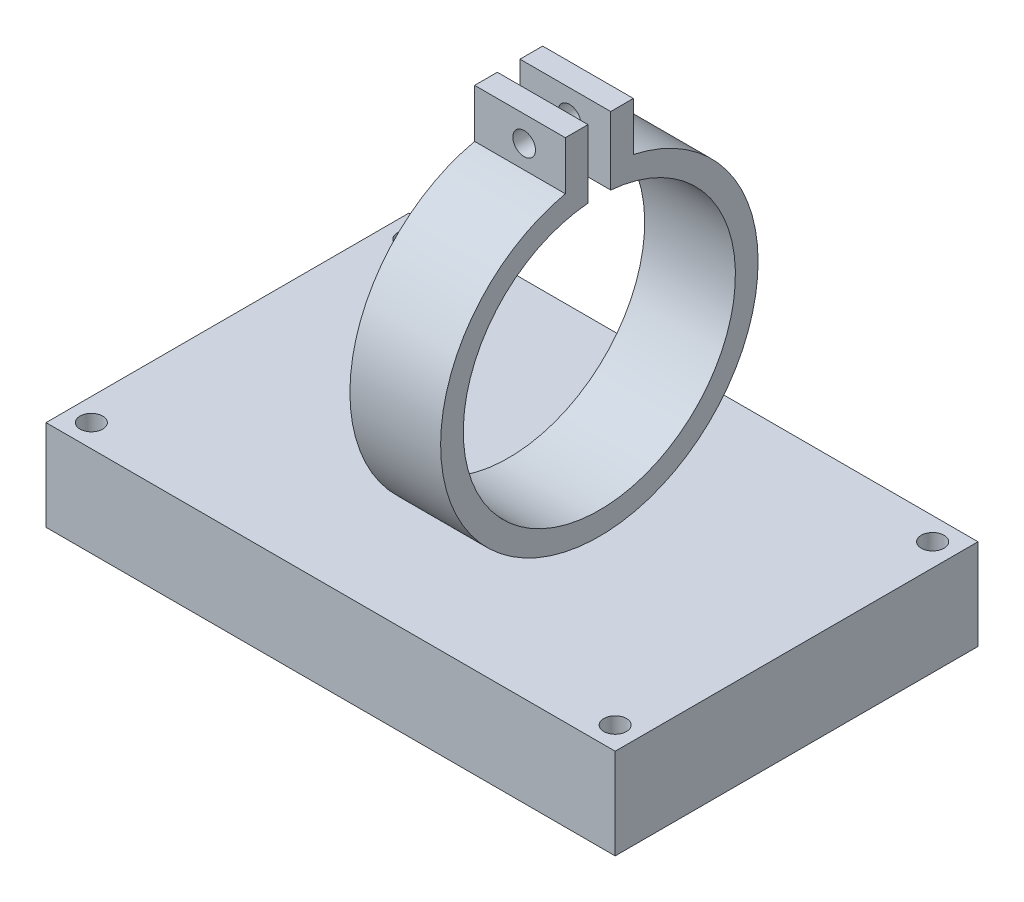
ISO-10303-21;
HEADER;
FILE_DESCRIPTION(('STEP AP214'),'2;1');
FILE_NAME('part.step','',(''),(''),'','','');
FILE_SCHEMA(('AUTOMOTIVE_DESIGN { 1 0 10303 214 1 1 1 1 }'));
ENDSEC;
DATA;
#1=APPLICATION_CONTEXT('core data for automotive mechanical design processes');
#2=APPLICATION_PROTOCOL_DEFINITION('international standard','automotive_design',2000,#1);
#3=PRODUCT_CONTEXT('',#1,'mechanical');
#4=PRODUCT('Part','Part','',(#3));
#5=PRODUCT_RELATED_PRODUCT_CATEGORY('part','',(#4));
#6=PRODUCT_DEFINITION_FORMATION('','',#4);
#7=PRODUCT_DEFINITION_CONTEXT('part definition',#1,'design');
#8=PRODUCT_DEFINITION('design','',#6,#7);
#9=PRODUCT_DEFINITION_SHAPE('','',#8);
#10=(LENGTH_UNIT() NAMED_UNIT(*) SI_UNIT(.MILLI.,.METRE.));
#11=(NAMED_UNIT(*) PLANE_ANGLE_UNIT() SI_UNIT($,.RADIAN.));
#12=(NAMED_UNIT(*) SI_UNIT($,.STERADIAN.) SOLID_ANGLE_UNIT());
#13=UNCERTAINTY_MEASURE_WITH_UNIT(LENGTH_MEASURE(1.E-05),#10,'distance_accuracy_value','');
#14=(GEOMETRIC_REPRESENTATION_CONTEXT(3) GLOBAL_UNCERTAINTY_ASSIGNED_CONTEXT((#13)) GLOBAL_UNIT_ASSIGNED_CONTEXT((#10,
#11,#12)) REPRESENTATION_CONTEXT('',''));
#15=CARTESIAN_POINT('',(0.,0.,0.));
#16=DIRECTION('',(0.,0.,1.));
#17=DIRECTION('',(1.,0.,0.));
#18=AXIS2_PLACEMENT_3D('',#15,#16,#17);
#19=CARTESIAN_POINT('',(20.,55.,0.737992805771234));
#20=DIRECTION('',(-1.,0.,0.));
#21=DIRECTION('',(0.,0.,1.));
#22=AXIS2_PLACEMENT_3D('',#19,#20,#21);
#23=CYLINDRICAL_SURFACE('',#22,35.);
#24=CARTESIAN_POINT('',(20.,55.,0.737992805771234));
#25=DIRECTION('',(1.,0.,0.));
#26=DIRECTION('',(0.,0.,-1.));
#27=AXIS2_PLACEMENT_3D('',#24,#25,#26);
#28=CIRCLE('',#27,35.);
#29=CARTESIAN_POINT('',(20.,89.1869858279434,8.23799280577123));
#30=VERTEX_POINT('',#29);
#31=CARTESIAN_POINT('',(20.,89.1869858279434,-6.76200719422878));
#32=VERTEX_POINT('',#31);
#33=EDGE_CURVE('E99',#30,#32,#28,.T.);
#34=ORIENTED_EDGE('',*,*,#33,.F.);
#35=DIRECTION('',(-1.,0.,0.));
#36=VECTOR('',#35,1.);
#37=CARTESIAN_POINT('',(20.,89.1869858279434,8.23799280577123));
#38=LINE('',#37,#36);
#39=CARTESIAN_POINT('',(0.,89.1869858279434,8.23799280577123));
#40=VERTEX_POINT('',#39);
#41=EDGE_CURVE('E128',#30,#40,#38,.T.);
#42=ORIENTED_EDGE('',*,*,#41,.T.);
#43=CARTESIAN_POINT('',(0.,55.,0.737992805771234));
#44=DIRECTION('',(1.,0.,0.));
#45=DIRECTION('',(0.,0.,-1.));
#46=AXIS2_PLACEMENT_3D('',#43,#44,#45);
#47=CIRCLE('',#46,35.);
#48=CARTESIAN_POINT('',(0.,89.1869858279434,-6.76200719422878));
#49=VERTEX_POINT('',#48);
#50=EDGE_CURVE('E105',#40,#49,#47,.T.);
#51=ORIENTED_EDGE('',*,*,#50,.T.);
#52=DIRECTION('',(-1.,0.,0.));
#53=VECTOR('',#52,1.);
#54=CARTESIAN_POINT('',(20.,89.1869858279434,-6.76200719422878));
#55=LINE('',#54,#53);
#56=EDGE_CURVE('E108',#49,#32,#55,.F.);
#57=ORIENTED_EDGE('',*,*,#56,.T.);
#58=EDGE_LOOP('',(#34,#42,#51,#57));
#59=FACE_BOUND('',#58,.T.);
#60=ADVANCED_FACE('F42',(#59),#23,.T.);
#61=CARTESIAN_POINT('',(20.,84.8956518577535,-1.76200719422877));
#62=DIRECTION('',(0.,0.,-1.));
#63=DIRECTION('',(-1.,0.,0.));
#64=AXIS2_PLACEMENT_3D('',#61,#62,#63);
#65=PLANE('',#64);
#66=CARTESIAN_POINT('',(10.9197704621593,94.2329502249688,-1.76200719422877));
#67=DIRECTION('',(0.,0.,-1.));
#68=DIRECTION('',(-1.,0.,0.));
#69=AXIS2_PLACEMENT_3D('',#66,#67,#68);
#70=CIRCLE('',#69,2.5);
#71=CARTESIAN_POINT('',(8.41977046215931,94.2329502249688,-1.76200719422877));
#72=VERTEX_POINT('',#71);
#73=EDGE_CURVE('E144',#72,#72,#70,.T.);
#74=ORIENTED_EDGE('',*,*,#73,.T.);
#75=EDGE_LOOP('',(#74));
#76=FACE_BOUND('',#75,.T.);
#77=DIRECTION('',(0.,-1.,0.));
#78=VECTOR('',#77,1.);
#79=CARTESIAN_POINT('',(0.,84.8956518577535,-1.76200719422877));
#80=LINE('',#79,#78);
#81=CARTESIAN_POINT('',(0.,99.8956518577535,-1.76200719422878));
#82=VERTEX_POINT('',#81);
#83=CARTESIAN_POINT('',(0.,84.8956518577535,-1.76200719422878));
#84=VERTEX_POINT('',#83);
#85=EDGE_CURVE('E85',#82,#84,#80,.T.);
#86=ORIENTED_EDGE('',*,*,#85,.T.);
#87=DIRECTION('',(-1.,0.,0.));
#88=VECTOR('',#87,1.);
#89=CARTESIAN_POINT('',(20.,84.8956518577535,-1.76200719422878));
#90=LINE('',#89,#88);
#91=CARTESIAN_POINT('',(20.,84.8956518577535,-1.76200719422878));
#92=VERTEX_POINT('',#91);
#93=EDGE_CURVE('E12',#92,#84,#90,.T.);
#94=ORIENTED_EDGE('',*,*,#93,.F.);
#95=DIRECTION('',(0.,-1.,0.));
#96=VECTOR('',#95,1.);
#97=CARTESIAN_POINT('',(20.,84.8956518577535,-1.76200719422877));
#98=LINE('',#97,#96);
#99=CARTESIAN_POINT('',(20.,99.8956518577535,-1.76200719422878));
#100=VERTEX_POINT('',#99);
#101=EDGE_CURVE('E101',#100,#92,#98,.T.);
#102=ORIENTED_EDGE('',*,*,#101,.F.);
#103=DIRECTION('',(1.,0.,0.));
#104=VECTOR('',#103,1.);
#105=CARTESIAN_POINT('',(0.,99.8956518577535,-1.76200719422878));
#106=LINE('',#105,#104);
#107=EDGE_CURVE('E114',#82,#100,#106,.T.);
#108=ORIENTED_EDGE('',*,*,#107,.F.);
#109=EDGE_LOOP('',(#86,#94,#102,#108));
#110=FACE_BOUND('',#109,.T.);
#111=ADVANCED_FACE('F203',(#76,#110),#65,.F.);
#112=CARTESIAN_POINT('',(20.,55.,0.737992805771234));
#113=DIRECTION('',(-1.,0.,0.));
#114=DIRECTION('',(0.,0.,1.));
#115=AXIS2_PLACEMENT_3D('',#112,#113,#114);
#116=CYLINDRICAL_SURFACE('',#115,30.);
#117=CARTESIAN_POINT('',(0.,55.,0.737992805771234));
#118=DIRECTION('',(-1.,0.,0.));
#119=DIRECTION('',(0.,0.,-1.));
#120=AXIS2_PLACEMENT_3D('',#117,#118,#119);
#121=CIRCLE('',#120,30.);
#122=CARTESIAN_POINT('',(0.,84.8956518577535,3.23799280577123));
#123=VERTEX_POINT('',#122);
#124=EDGE_CURVE('E76',#84,#123,#121,.T.);
#125=ORIENTED_EDGE('',*,*,#124,.T.);
#126=DIRECTION('',(-1.,0.,0.));
#127=VECTOR('',#126,1.);
#128=CARTESIAN_POINT('',(20.,84.8956518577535,3.23799280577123));
#129=LINE('',#128,#127);
#130=CARTESIAN_POINT('',(20.,84.8956518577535,3.23799280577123));
#131=VERTEX_POINT('',#130);
#132=EDGE_CURVE('E49',#131,#123,#129,.T.);
#133=ORIENTED_EDGE('',*,*,#132,.F.);
#134=CARTESIAN_POINT('',(20.,55.,0.737992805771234));
#135=DIRECTION('',(-1.,0.,0.));
#136=DIRECTION('',(0.,0.,-1.));
#137=AXIS2_PLACEMENT_3D('',#134,#135,#136);
#138=CIRCLE('',#137,30.);
#139=EDGE_CURVE('E64',#92,#131,#138,.T.);
#140=ORIENTED_EDGE('',*,*,#139,.F.);
#141=ORIENTED_EDGE('',*,*,#93,.T.);
#142=EDGE_LOOP('',(#125,#133,#140,#141));
#143=FACE_BOUND('',#142,.T.);
#144=ADVANCED_FACE('F78',(#143),#116,.F.);
#145=CARTESIAN_POINT('',(20.,84.8956518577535,3.23799280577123));
#146=DIRECTION('',(0.,0.,1.));
#147=DIRECTION('',(1.,0.,0.));
#148=AXIS2_PLACEMENT_3D('',#145,#146,#147);
#149=PLANE('',#148);
#150=CARTESIAN_POINT('',(10.9197704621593,94.2329502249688,3.23799280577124));
#151=DIRECTION('',(0.,0.,1.));
#152=DIRECTION('',(1.,0.,0.));
#153=AXIS2_PLACEMENT_3D('',#150,#151,#152);
#154=CIRCLE('',#153,2.5);
#155=CARTESIAN_POINT('',(13.4197704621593,94.2329502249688,3.23799280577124));
#156=VERTEX_POINT('',#155);
#157=EDGE_CURVE('E150',#156,#156,#154,.T.);
#158=ORIENTED_EDGE('',*,*,#157,.T.);
#159=EDGE_LOOP('',(#158));
#160=FACE_BOUND('',#159,.T.);
#161=DIRECTION('',(0.,1.,0.));
#162=VECTOR('',#161,1.);
#163=CARTESIAN_POINT('',(0.,84.8956518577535,3.23799280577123));
#164=LINE('',#163,#162);
#165=CARTESIAN_POINT('',(0.,99.8956518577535,3.23799280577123));
#166=VERTEX_POINT('',#165);
#167=EDGE_CURVE('E84',#123,#166,#164,.T.);
#168=ORIENTED_EDGE('',*,*,#167,.T.);
#169=DIRECTION('',(1.,0.,0.));
#170=VECTOR('',#169,1.);
#171=CARTESIAN_POINT('',(0.,99.8956518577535,3.23799280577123));
#172=LINE('',#171,#170);
#173=CARTESIAN_POINT('',(20.,99.8956518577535,3.23799280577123));
#174=VERTEX_POINT('',#173);
#175=EDGE_CURVE('E136',#166,#174,#172,.T.);
#176=ORIENTED_EDGE('',*,*,#175,.T.);
#177=DIRECTION('',(0.,1.,0.));
#178=VECTOR('',#177,1.);
#179=CARTESIAN_POINT('',(20.,84.8956518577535,3.23799280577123));
#180=LINE('',#179,#178);
#181=EDGE_CURVE('E93',#131,#174,#180,.T.);
#182=ORIENTED_EDGE('',*,*,#181,.F.);
#183=ORIENTED_EDGE('',*,*,#132,.T.);
#184=EDGE_LOOP('',(#168,#176,#182,#183));
#185=FACE_BOUND('',#184,.T.);
#186=ADVANCED_FACE('F89',(#160,#185),#149,.F.);
#187=CARTESIAN_POINT('',(20.,55.,0.737992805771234));
#188=DIRECTION('',(1.,0.,0.));
#189=DIRECTION('',(0.,0.,-1.));
#190=AXIS2_PLACEMENT_3D('',#187,#188,#189);
#191=PLANE('',#190);
#192=ORIENTED_EDGE('',*,*,#139,.T.);
#193=ORIENTED_EDGE('',*,*,#181,.T.);
#194=DIRECTION('',(0.,0.,1.));
#195=VECTOR('',#194,1.);
#196=CARTESIAN_POINT('',(20.,99.8956518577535,3.23799280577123));
#197=LINE('',#196,#195);
#198=CARTESIAN_POINT('',(20.,99.8956518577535,8.23799280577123));
#199=VERTEX_POINT('',#198);
#200=EDGE_CURVE('E142',#174,#199,#197,.T.);
#201=ORIENTED_EDGE('',*,*,#200,.T.);
#202=DIRECTION('',(0.,-1.,0.));
#203=VECTOR('',#202,1.);
#204=CARTESIAN_POINT('',(20.,84.8956518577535,8.23799280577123));
#205=LINE('',#204,#203);
#206=EDGE_CURVE('E56',#199,#30,#205,.T.);
#207=ORIENTED_EDGE('',*,*,#206,.T.);
#208=ORIENTED_EDGE('',*,*,#33,.T.);
#209=DIRECTION('',(0.,1.,0.));
#210=VECTOR('',#209,1.);
#211=CARTESIAN_POINT('',(20.,84.8956518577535,-6.76200719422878));
#212=LINE('',#211,#210);
#213=CARTESIAN_POINT('',(20.,99.8956518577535,-6.76200719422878));
#214=VERTEX_POINT('',#213);
#215=EDGE_CURVE('E125',#32,#214,#212,.T.);
#216=ORIENTED_EDGE('',*,*,#215,.T.);
#217=DIRECTION('',(0.,0.,1.));
#218=VECTOR('',#217,1.);
#219=CARTESIAN_POINT('',(20.,99.8956518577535,-1.76200719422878));
#220=LINE('',#219,#218);
#221=EDGE_CURVE('E121',#214,#100,#220,.T.);
#222=ORIENTED_EDGE('',*,*,#221,.T.);
#223=ORIENTED_EDGE('',*,*,#101,.T.);
#224=EDGE_LOOP('',(#192,#193,#201,#207,#208,#216,#222,#223));
#225=FACE_BOUND('',#224,.T.);
#226=ADVANCED_FACE('F178',(#225),#191,.T.);
#227=CARTESIAN_POINT('',(0.,55.,0.737992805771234));
#228=DIRECTION('',(1.,0.,0.));
#229=DIRECTION('',(0.,0.,-1.));
#230=AXIS2_PLACEMENT_3D('',#227,#228,#229);
#231=PLANE('',#230);
#232=ORIENTED_EDGE('',*,*,#167,.F.);
#233=ORIENTED_EDGE('',*,*,#124,.F.);
#234=ORIENTED_EDGE('',*,*,#85,.F.);
#235=DIRECTION('',(0.,0.,1.));
#236=VECTOR('',#235,1.);
#237=CARTESIAN_POINT('',(0.,99.8956518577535,-1.76200719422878));
#238=LINE('',#237,#236);
#239=CARTESIAN_POINT('',(0.,99.8956518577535,-6.76200719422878));
#240=VERTEX_POINT('',#239);
#241=EDGE_CURVE('E118',#240,#82,#238,.T.);
#242=ORIENTED_EDGE('',*,*,#241,.F.);
#243=DIRECTION('',(0.,1.,0.));
#244=VECTOR('',#243,1.);
#245=CARTESIAN_POINT('',(0.,84.8956518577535,-6.76200719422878));
#246=LINE('',#245,#244);
#247=EDGE_CURVE('E124',#49,#240,#246,.T.);
#248=ORIENTED_EDGE('',*,*,#247,.F.);
#249=ORIENTED_EDGE('',*,*,#50,.F.);
#250=DIRECTION('',(0.,-1.,0.));
#251=VECTOR('',#250,1.);
#252=CARTESIAN_POINT('',(0.,84.8956518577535,8.23799280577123));
#253=LINE('',#252,#251);
#254=CARTESIAN_POINT('',(0.,99.8956518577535,8.23799280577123));
#255=VERTEX_POINT('',#254);
#256=EDGE_CURVE('E138',#255,#40,#253,.T.);
#257=ORIENTED_EDGE('',*,*,#256,.F.);
#258=DIRECTION('',(0.,0.,1.));
#259=VECTOR('',#258,1.);
#260=CARTESIAN_POINT('',(0.,99.8956518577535,3.23799280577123));
#261=LINE('',#260,#259);
#262=EDGE_CURVE('E98',#166,#255,#261,.T.);
#263=ORIENTED_EDGE('',*,*,#262,.F.);
#264=EDGE_LOOP('',(#232,#233,#234,#242,#248,#249,#257,#263));
#265=FACE_BOUND('',#264,.T.);
#266=ADVANCED_FACE('F95',(#265),#231,.F.);
#267=CARTESIAN_POINT('',(0.,84.8956518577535,-6.76200719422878));
#268=DIRECTION('',(0.,0.,-1.));
#269=DIRECTION('',(-1.,0.,0.));
#270=AXIS2_PLACEMENT_3D('',#267,#268,#269);
#271=PLANE('',#270);
#272=CARTESIAN_POINT('',(10.9197704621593,94.2329502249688,-6.76200719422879));
#273=DIRECTION('',(0.,0.,-1.));
#274=DIRECTION('',(-1.,0.,0.));
#275=AXIS2_PLACEMENT_3D('',#272,#273,#274);
#276=CIRCLE('',#275,2.5);
#277=CARTESIAN_POINT('',(8.41977046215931,94.2329502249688,-6.76200719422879));
#278=VERTEX_POINT('',#277);
#279=EDGE_CURVE('E153',#278,#278,#276,.T.);
#280=ORIENTED_EDGE('',*,*,#279,.F.);
#281=EDGE_LOOP('',(#280));
#282=FACE_BOUND('',#281,.T.);
#283=ORIENTED_EDGE('',*,*,#56,.F.);
#284=ORIENTED_EDGE('',*,*,#247,.T.);
#285=DIRECTION('',(1.,0.,0.));
#286=VECTOR('',#285,1.);
#287=CARTESIAN_POINT('',(0.,99.8956518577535,-6.76200719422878));
#288=LINE('',#287,#286);
#289=EDGE_CURVE('E115',#240,#214,#288,.T.);
#290=ORIENTED_EDGE('',*,*,#289,.T.);
#291=ORIENTED_EDGE('',*,*,#215,.F.);
#292=EDGE_LOOP('',(#283,#284,#290,#291));
#293=FACE_BOUND('',#292,.T.);
#294=ADVANCED_FACE('F183',(#282,#293),#271,.T.);
#295=CARTESIAN_POINT('',(0.,99.8956518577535,-1.76200719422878));
#296=DIRECTION('',(0.,1.,0.));
#297=DIRECTION('',(0.,0.,1.));
#298=AXIS2_PLACEMENT_3D('',#295,#296,#297);
#299=PLANE('',#298);
#300=ORIENTED_EDGE('',*,*,#221,.F.);
#301=ORIENTED_EDGE('',*,*,#289,.F.);
#302=ORIENTED_EDGE('',*,*,#241,.T.);
#303=ORIENTED_EDGE('',*,*,#107,.T.);
#304=EDGE_LOOP('',(#300,#301,#302,#303));
#305=FACE_BOUND('',#304,.T.);
#306=ADVANCED_FACE('F167',(#305),#299,.T.);
#307=CARTESIAN_POINT('',(0.,84.8956518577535,8.23799280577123));
#308=DIRECTION('',(0.,0.,1.));
#309=DIRECTION('',(1.,0.,0.));
#310=AXIS2_PLACEMENT_3D('',#307,#308,#309);
#311=PLANE('',#310);
#312=CARTESIAN_POINT('',(10.9197704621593,94.2329502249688,8.23799280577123));
#313=DIRECTION('',(0.,0.,1.));
#314=DIRECTION('',(1.,0.,0.));
#315=AXIS2_PLACEMENT_3D('',#312,#313,#314);
#316=CIRCLE('',#315,2.5);
#317=CARTESIAN_POINT('',(13.4197704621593,94.2329502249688,8.23799280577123));
#318=VERTEX_POINT('',#317);
#319=EDGE_CURVE('E156',#318,#318,#316,.T.);
#320=ORIENTED_EDGE('',*,*,#319,.F.);
#321=EDGE_LOOP('',(#320));
#322=FACE_BOUND('',#321,.T.);
#323=ORIENTED_EDGE('',*,*,#41,.F.);
#324=ORIENTED_EDGE('',*,*,#206,.F.);
#325=DIRECTION('',(1.,0.,0.));
#326=VECTOR('',#325,1.);
#327=CARTESIAN_POINT('',(0.,99.8956518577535,8.23799280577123));
#328=LINE('',#327,#326);
#329=EDGE_CURVE('E135',#255,#199,#328,.T.);
#330=ORIENTED_EDGE('',*,*,#329,.F.);
#331=ORIENTED_EDGE('',*,*,#256,.T.);
#332=EDGE_LOOP('',(#323,#324,#330,#331));
#333=FACE_BOUND('',#332,.T.);
#334=ADVANCED_FACE('F163',(#322,#333),#311,.T.);
#335=CARTESIAN_POINT('',(0.,99.8956518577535,3.23799280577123));
#336=DIRECTION('',(0.,1.,0.));
#337=DIRECTION('',(0.,0.,1.));
#338=AXIS2_PLACEMENT_3D('',#335,#336,#337);
#339=PLANE('',#338);
#340=ORIENTED_EDGE('',*,*,#200,.F.);
#341=ORIENTED_EDGE('',*,*,#175,.F.);
#342=ORIENTED_EDGE('',*,*,#262,.T.);
#343=ORIENTED_EDGE('',*,*,#329,.T.);
#344=EDGE_LOOP('',(#340,#341,#342,#343));
#345=FACE_BOUND('',#344,.T.);
#346=ADVANCED_FACE('F166',(#345),#339,.T.);
#347=CARTESIAN_POINT('',(10.9197704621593,94.2329502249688,-91.7620071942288));
#348=DIRECTION('',(0.,0.,1.));
#349=DIRECTION('',(1.,0.,0.));
#350=AXIS2_PLACEMENT_3D('',#347,#348,#349);
#351=CYLINDRICAL_SURFACE('',#350,2.5);
#352=ORIENTED_EDGE('',*,*,#319,.T.);
#353=EDGE_LOOP('',(#352));
#354=FACE_BOUND('',#353,.T.);
#355=ORIENTED_EDGE('',*,*,#157,.F.);
#356=EDGE_LOOP('',(#355));
#357=FACE_BOUND('',#356,.T.);
#358=ADVANCED_FACE('F160',(#354,#357),#351,.F.);
#359=ORIENTED_EDGE('',*,*,#279,.T.);
#360=EDGE_LOOP('',(#359));
#361=FACE_BOUND('',#360,.T.);
#362=ORIENTED_EDGE('',*,*,#73,.F.);
#363=EDGE_LOOP('',(#362));
#364=FACE_BOUND('',#363,.T.);
#365=ADVANCED_FACE('F227',(#361,#364),#351,.F.);
#366=CLOSED_SHELL('',(#60,#111,#144,#186,#226,#266,#294,#306,#334,#346,#358,#365));
#367=MANIFOLD_SOLID_BREP('B2',#366);
#368=CARTESIAN_POINT('',(0.,20.,0.));
#369=DIRECTION('',(0.,-1.,0.));
#370=DIRECTION('',(0.,0.,-1.));
#371=AXIS2_PLACEMENT_3D('',#368,#369,#370);
#372=PLANE('',#371);
#373=DIRECTION('',(0.,0.,-1.));
#374=VECTOR('',#373,1.);
#375=CARTESIAN_POINT('',(62.75,20.,40.));
#376=LINE('',#375,#374);
#377=CARTESIAN_POINT('',(62.75,20.,40.));
#378=VERTEX_POINT('',#377);
#379=CARTESIAN_POINT('',(62.75,20.,-40.));
#380=VERTEX_POINT('',#379);
#381=EDGE_CURVE('E380',#378,#380,#376,.T.);
#382=ORIENTED_EDGE('',*,*,#381,.T.);
#383=DIRECTION('',(-1.,0.,0.));
#384=VECTOR('',#383,1.);
#385=CARTESIAN_POINT('',(-62.75,20.,-40.));
#386=LINE('',#385,#384);
#387=CARTESIAN_POINT('',(-62.75,20.,-40.));
#388=VERTEX_POINT('',#387);
#389=EDGE_CURVE('E375',#380,#388,#386,.T.);
#390=ORIENTED_EDGE('',*,*,#389,.T.);
#391=DIRECTION('',(0.,0.,1.));
#392=VECTOR('',#391,1.);
#393=CARTESIAN_POINT('',(-62.75,20.,40.));
#394=LINE('',#393,#392);
#395=CARTESIAN_POINT('',(-62.75,20.,40.));
#396=VERTEX_POINT('',#395);
#397=EDGE_CURVE('E378',#388,#396,#394,.T.);
#398=ORIENTED_EDGE('',*,*,#397,.T.);
#399=DIRECTION('',(1.,0.,0.));
#400=VECTOR('',#399,1.);
#401=CARTESIAN_POINT('',(-62.75,20.,40.));
#402=LINE('',#401,#400);
#403=EDGE_CURVE('E345',#396,#378,#402,.T.);
#404=ORIENTED_EDGE('',*,*,#403,.T.);
#405=EDGE_LOOP('',(#382,#390,#398,#404));
#406=FACE_BOUND('',#405,.T.);
#407=CARTESIAN_POINT('',(-57.75,20.,-35.));
#408=DIRECTION('',(0.,1.,0.));
#409=DIRECTION('',(0.,0.,1.));
#410=AXIS2_PLACEMENT_3D('',#407,#408,#409);
#411=CIRCLE('',#410,2.5);
#412=CARTESIAN_POINT('',(-57.75,20.,-32.5));
#413=VERTEX_POINT('',#412);
#414=EDGE_CURVE('E395',#413,#413,#411,.T.);
#415=ORIENTED_EDGE('',*,*,#414,.F.);
#416=EDGE_LOOP('',(#415));
#417=FACE_BOUND('',#416,.T.);
#418=CARTESIAN_POINT('',(-57.75,20.,35.));
#419=DIRECTION('',(0.,1.,0.));
#420=DIRECTION('',(0.,0.,1.));
#421=AXIS2_PLACEMENT_3D('',#418,#419,#420);
#422=CIRCLE('',#421,2.5);
#423=CARTESIAN_POINT('',(-57.75,20.,37.5));
#424=VERTEX_POINT('',#423);
#425=EDGE_CURVE('E410',#424,#424,#422,.T.);
#426=ORIENTED_EDGE('',*,*,#425,.F.);
#427=EDGE_LOOP('',(#426));
#428=FACE_BOUND('',#427,.T.);
#429=CARTESIAN_POINT('',(57.75,20.,-35.));
#430=DIRECTION('',(0.,1.,0.));
#431=DIRECTION('',(0.,0.,1.));
#432=AXIS2_PLACEMENT_3D('',#429,#430,#431);
#433=CIRCLE('',#432,2.5);
#434=CARTESIAN_POINT('',(57.75,20.,-32.5));
#435=VERTEX_POINT('',#434);
#436=EDGE_CURVE('E416',#435,#435,#433,.T.);
#437=ORIENTED_EDGE('',*,*,#436,.F.);
#438=EDGE_LOOP('',(#437));
#439=FACE_BOUND('',#438,.T.);
#440=CARTESIAN_POINT('',(57.75,20.,35.));
#441=DIRECTION('',(0.,1.,0.));
#442=DIRECTION('',(0.,0.,1.));
#443=AXIS2_PLACEMENT_3D('',#440,#441,#442);
#444=CIRCLE('',#443,2.5);
#445=CARTESIAN_POINT('',(57.75,20.,37.5));
#446=VERTEX_POINT('',#445);
#447=EDGE_CURVE('E422',#446,#446,#444,.T.);
#448=ORIENTED_EDGE('',*,*,#447,.F.);
#449=EDGE_LOOP('',(#448));
#450=FACE_BOUND('',#449,.T.);
#451=ADVANCED_FACE('F328',(#406,#417,#428,#439,#450),#372,.F.);
#452=CARTESIAN_POINT('',(0.,0.,0.));
#453=DIRECTION('',(0.,-1.,0.));
#454=DIRECTION('',(0.,0.,-1.));
#455=AXIS2_PLACEMENT_3D('',#452,#453,#454);
#456=PLANE('',#455);
#457=CARTESIAN_POINT('',(57.75,0.,-35.));
#458=DIRECTION('',(0.,1.,0.));
#459=DIRECTION('',(0.,0.,1.));
#460=AXIS2_PLACEMENT_3D('',#457,#458,#459);
#461=CIRCLE('',#460,2.5);
#462=CARTESIAN_POINT('',(57.75,0.,-32.5));
#463=VERTEX_POINT('',#462);
#464=EDGE_CURVE('E419',#463,#463,#461,.T.);
#465=ORIENTED_EDGE('',*,*,#464,.T.);
#466=EDGE_LOOP('',(#465));
#467=FACE_BOUND('',#466,.T.);
#468=CARTESIAN_POINT('',(-57.75,0.,-35.));
#469=DIRECTION('',(0.,1.,0.));
#470=DIRECTION('',(0.,0.,1.));
#471=AXIS2_PLACEMENT_3D('',#468,#469,#470);
#472=CIRCLE('',#471,2.5);
#473=CARTESIAN_POINT('',(-57.75,0.,-32.5));
#474=VERTEX_POINT('',#473);
#475=EDGE_CURVE('E407',#474,#474,#472,.T.);
#476=ORIENTED_EDGE('',*,*,#475,.T.);
#477=EDGE_LOOP('',(#476));
#478=FACE_BOUND('',#477,.T.);
#479=DIRECTION('',(0.,0.,-1.));
#480=VECTOR('',#479,1.);
#481=CARTESIAN_POINT('',(62.75,0.,40.));
#482=LINE('',#481,#480);
#483=CARTESIAN_POINT('',(62.75,0.,40.));
#484=VERTEX_POINT('',#483);
#485=CARTESIAN_POINT('',(62.75,0.,-40.));
#486=VERTEX_POINT('',#485);
#487=EDGE_CURVE('E392',#484,#486,#482,.T.);
#488=ORIENTED_EDGE('',*,*,#487,.F.);
#489=DIRECTION('',(1.,0.,0.));
#490=VECTOR('',#489,1.);
#491=CARTESIAN_POINT('',(-62.75,0.,40.));
#492=LINE('',#491,#490);
#493=CARTESIAN_POINT('',(-62.75,0.,40.));
#494=VERTEX_POINT('',#493);
#495=EDGE_CURVE('E368',#494,#484,#492,.T.);
#496=ORIENTED_EDGE('',*,*,#495,.F.);
#497=DIRECTION('',(0.,0.,1.));
#498=VECTOR('',#497,1.);
#499=CARTESIAN_POINT('',(-62.75,0.,40.));
#500=LINE('',#499,#498);
#501=CARTESIAN_POINT('',(-62.75,0.,-40.));
#502=VERTEX_POINT('',#501);
#503=EDGE_CURVE('E362',#502,#494,#500,.T.);
#504=ORIENTED_EDGE('',*,*,#503,.F.);
#505=DIRECTION('',(-1.,0.,0.));
#506=VECTOR('',#505,1.);
#507=CARTESIAN_POINT('',(-62.75,0.,-40.));
#508=LINE('',#507,#506);
#509=EDGE_CURVE('E384',#486,#502,#508,.T.);
#510=ORIENTED_EDGE('',*,*,#509,.F.);
#511=EDGE_LOOP('',(#488,#496,#504,#510));
#512=FACE_BOUND('',#511,.T.);
#513=CARTESIAN_POINT('',(-57.75,0.,35.));
#514=DIRECTION('',(0.,1.,0.));
#515=DIRECTION('',(0.,0.,1.));
#516=AXIS2_PLACEMENT_3D('',#513,#514,#515);
#517=CIRCLE('',#516,2.5);
#518=CARTESIAN_POINT('',(-57.75,0.,37.5));
#519=VERTEX_POINT('',#518);
#520=EDGE_CURVE('E413',#519,#519,#517,.T.);
#521=ORIENTED_EDGE('',*,*,#520,.T.);
#522=EDGE_LOOP('',(#521));
#523=FACE_BOUND('',#522,.T.);
#524=CARTESIAN_POINT('',(57.75,0.,35.));
#525=DIRECTION('',(0.,1.,0.));
#526=DIRECTION('',(0.,0.,1.));
#527=AXIS2_PLACEMENT_3D('',#524,#525,#526);
#528=CIRCLE('',#527,2.5);
#529=CARTESIAN_POINT('',(57.75,0.,37.5));
#530=VERTEX_POINT('',#529);
#531=EDGE_CURVE('E425',#530,#530,#528,.T.);
#532=ORIENTED_EDGE('',*,*,#531,.T.);
#533=EDGE_LOOP('',(#532));
#534=FACE_BOUND('',#533,.T.);
#535=ADVANCED_FACE('F403',(#467,#478,#512,#523,#534),#456,.T.);
#536=CARTESIAN_POINT('',(62.75,20.,40.));
#537=DIRECTION('',(-1.,0.,0.));
#538=DIRECTION('',(0.,0.,1.));
#539=AXIS2_PLACEMENT_3D('',#536,#537,#538);
#540=PLANE('',#539);
#541=ORIENTED_EDGE('',*,*,#487,.T.);
#542=DIRECTION('',(0.,-1.,0.));
#543=VECTOR('',#542,1.);
#544=CARTESIAN_POINT('',(62.75,20.,-40.));
#545=LINE('',#544,#543);
#546=EDGE_CURVE('E40',#380,#486,#545,.T.);
#547=ORIENTED_EDGE('',*,*,#546,.F.);
#548=ORIENTED_EDGE('',*,*,#381,.F.);
#549=DIRECTION('',(0.,-1.,0.));
#550=VECTOR('',#549,1.);
#551=CARTESIAN_POINT('',(62.75,20.,40.));
#552=LINE('',#551,#550);
#553=EDGE_CURVE('E388',#378,#484,#552,.T.);
#554=ORIENTED_EDGE('',*,*,#553,.T.);
#555=EDGE_LOOP('',(#541,#547,#548,#554));
#556=FACE_BOUND('',#555,.T.);
#557=ADVANCED_FACE('F330',(#556),#540,.F.);
#558=CARTESIAN_POINT('',(-62.75,20.,-40.));
#559=DIRECTION('',(0.,0.,1.));
#560=DIRECTION('',(1.,0.,0.));
#561=AXIS2_PLACEMENT_3D('',#558,#559,#560);
#562=PLANE('',#561);
#563=ORIENTED_EDGE('',*,*,#509,.T.);
#564=DIRECTION('',(0.,-1.,0.));
#565=VECTOR('',#564,1.);
#566=CARTESIAN_POINT('',(-62.75,20.,-40.));
#567=LINE('',#566,#565);
#568=EDGE_CURVE('E337',#388,#502,#567,.T.);
#569=ORIENTED_EDGE('',*,*,#568,.F.);
#570=ORIENTED_EDGE('',*,*,#389,.F.);
#571=ORIENTED_EDGE('',*,*,#546,.T.);
#572=EDGE_LOOP('',(#563,#569,#570,#571));
#573=FACE_BOUND('',#572,.T.);
#574=ADVANCED_FACE('F383',(#573),#562,.F.);
#575=CARTESIAN_POINT('',(-62.75,20.,40.));
#576=DIRECTION('',(1.,0.,0.));
#577=DIRECTION('',(0.,0.,-1.));
#578=AXIS2_PLACEMENT_3D('',#575,#576,#577);
#579=PLANE('',#578);
#580=ORIENTED_EDGE('',*,*,#503,.T.);
#581=DIRECTION('',(0.,-1.,0.));
#582=VECTOR('',#581,1.);
#583=CARTESIAN_POINT('',(-62.75,20.,40.));
#584=LINE('',#583,#582);
#585=EDGE_CURVE('E385',#396,#494,#584,.T.);
#586=ORIENTED_EDGE('',*,*,#585,.F.);
#587=ORIENTED_EDGE('',*,*,#397,.F.);
#588=ORIENTED_EDGE('',*,*,#568,.T.);
#589=EDGE_LOOP('',(#580,#586,#587,#588));
#590=FACE_BOUND('',#589,.T.);
#591=ADVANCED_FACE('F386',(#590),#579,.F.);
#592=CARTESIAN_POINT('',(-62.75,20.,40.));
#593=DIRECTION('',(0.,0.,-1.));
#594=DIRECTION('',(-1.,0.,0.));
#595=AXIS2_PLACEMENT_3D('',#592,#593,#594);
#596=PLANE('',#595);
#597=ORIENTED_EDGE('',*,*,#495,.T.);
#598=ORIENTED_EDGE('',*,*,#553,.F.);
#599=ORIENTED_EDGE('',*,*,#403,.F.);
#600=ORIENTED_EDGE('',*,*,#585,.T.);
#601=EDGE_LOOP('',(#597,#598,#599,#600));
#602=FACE_BOUND('',#601,.T.);
#603=ADVANCED_FACE('F400',(#602),#596,.F.);
#604=CARTESIAN_POINT('',(-57.75,20.,-35.));
#605=DIRECTION('',(0.,-1.,0.));
#606=DIRECTION('',(0.,0.,-1.));
#607=AXIS2_PLACEMENT_3D('',#604,#605,#606);
#608=CYLINDRICAL_SURFACE('',#607,2.5);
#609=ORIENTED_EDGE('',*,*,#414,.T.);
#610=EDGE_LOOP('',(#609));
#611=FACE_BOUND('',#610,.T.);
#612=ORIENTED_EDGE('',*,*,#475,.F.);
#613=EDGE_LOOP('',(#612));
#614=FACE_BOUND('',#613,.T.);
#615=ADVANCED_FACE('F442',(#611,#614),#608,.F.);
#616=CARTESIAN_POINT('',(-57.75,20.,35.));
#617=DIRECTION('',(0.,-1.,0.));
#618=DIRECTION('',(0.,0.,-1.));
#619=AXIS2_PLACEMENT_3D('',#616,#617,#618);
#620=CYLINDRICAL_SURFACE('',#619,2.5);
#621=ORIENTED_EDGE('',*,*,#425,.T.);
#622=EDGE_LOOP('',(#621));
#623=FACE_BOUND('',#622,.T.);
#624=ORIENTED_EDGE('',*,*,#520,.F.);
#625=EDGE_LOOP('',(#624));
#626=FACE_BOUND('',#625,.T.);
#627=ADVANCED_FACE('F487',(#623,#626),#620,.F.);
#628=CARTESIAN_POINT('',(57.75,20.,-35.));
#629=DIRECTION('',(0.,-1.,0.));
#630=DIRECTION('',(0.,0.,-1.));
#631=AXIS2_PLACEMENT_3D('',#628,#629,#630);
#632=CYLINDRICAL_SURFACE('',#631,2.5);
#633=ORIENTED_EDGE('',*,*,#436,.T.);
#634=EDGE_LOOP('',(#633));
#635=FACE_BOUND('',#634,.T.);
#636=ORIENTED_EDGE('',*,*,#464,.F.);
#637=EDGE_LOOP('',(#636));
#638=FACE_BOUND('',#637,.T.);
#639=ADVANCED_FACE('F495',(#635,#638),#632,.F.);
#640=CARTESIAN_POINT('',(57.75,20.,35.));
#641=DIRECTION('',(0.,-1.,0.));
#642=DIRECTION('',(0.,0.,-1.));
#643=AXIS2_PLACEMENT_3D('',#640,#641,#642);
#644=CYLINDRICAL_SURFACE('',#643,2.5);
#645=ORIENTED_EDGE('',*,*,#447,.T.);
#646=EDGE_LOOP('',(#645));
#647=FACE_BOUND('',#646,.T.);
#648=ORIENTED_EDGE('',*,*,#531,.F.);
#649=EDGE_LOOP('',(#648));
#650=FACE_BOUND('',#649,.T.);
#651=ADVANCED_FACE('F431',(#647,#650),#644,.F.);
#652=CLOSED_SHELL('',(#451,#535,#557,#574,#591,#603,#615,#627,#639,#651));
#653=MANIFOLD_SOLID_BREP('B6',#652);
#654=ADVANCED_BREP_SHAPE_REPRESENTATION('',(#18,#367,#653),#14);
#655=SHAPE_DEFINITION_REPRESENTATION(#9,#654);
ENDSEC;
END-ISO-10303-21;
